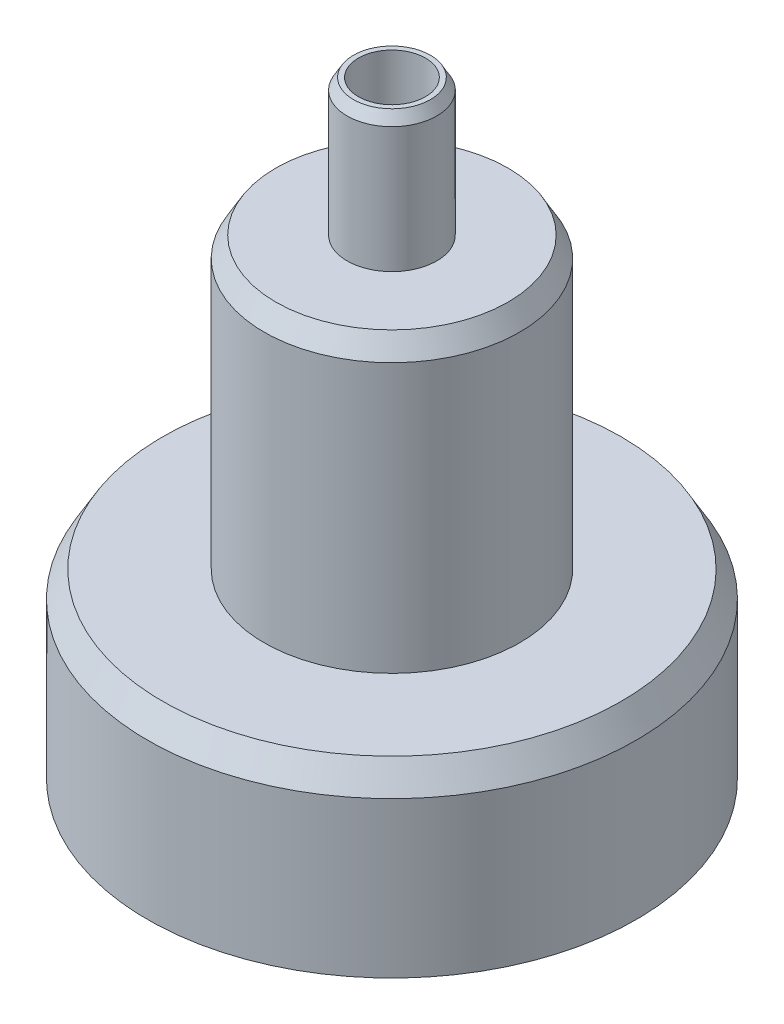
ISO-10303-21;
HEADER;
FILE_DESCRIPTION(('STEP AP214'),'2;1');
FILE_NAME('part.step','',(''),(''),'','','');
FILE_SCHEMA(('AUTOMOTIVE_DESIGN { 1 0 10303 214 1 1 1 1 }'));
ENDSEC;
DATA;
#1=APPLICATION_CONTEXT('core data for automotive mechanical design processes');
#2=APPLICATION_PROTOCOL_DEFINITION('international standard','automotive_design',2000,#1);
#3=PRODUCT_CONTEXT('',#1,'mechanical');
#4=PRODUCT('Part','Part','',(#3));
#5=PRODUCT_RELATED_PRODUCT_CATEGORY('part','',(#4));
#6=PRODUCT_DEFINITION_FORMATION('','',#4);
#7=PRODUCT_DEFINITION_CONTEXT('part definition',#1,'design');
#8=PRODUCT_DEFINITION('design','',#6,#7);
#9=PRODUCT_DEFINITION_SHAPE('','',#8);
#10=(LENGTH_UNIT() NAMED_UNIT(*) SI_UNIT(.MILLI.,.METRE.));
#11=(NAMED_UNIT(*) PLANE_ANGLE_UNIT() SI_UNIT($,.RADIAN.));
#12=(NAMED_UNIT(*) SI_UNIT($,.STERADIAN.) SOLID_ANGLE_UNIT());
#13=UNCERTAINTY_MEASURE_WITH_UNIT(LENGTH_MEASURE(1.E-05),#10,'distance_accuracy_value','');
#14=(GEOMETRIC_REPRESENTATION_CONTEXT(3) GLOBAL_UNCERTAINTY_ASSIGNED_CONTEXT((#13)) GLOBAL_UNIT_ASSIGNED_CONTEXT((#10,
#11,#12)) REPRESENTATION_CONTEXT('',''));
#15=CARTESIAN_POINT('',(0.,0.,0.));
#16=DIRECTION('',(0.,0.,1.));
#17=DIRECTION('',(1.,0.,0.));
#18=AXIS2_PLACEMENT_3D('',#15,#16,#17);
#19=CARTESIAN_POINT('',(0.,0.,0.));
#20=DIRECTION('',(0.,-1.,0.));
#21=DIRECTION('',(0.,0.,-1.));
#22=AXIS2_PLACEMENT_3D('',#19,#20,#21);
#23=CYLINDRICAL_SURFACE('',#22,34.6);
#24=CARTESIAN_POINT('',(0.,0.,0.));
#25=DIRECTION('',(0.,-1.,0.));
#26=DIRECTION('',(0.,0.,-1.));
#27=AXIS2_PLACEMENT_3D('',#24,#25,#26);
#28=CIRCLE('',#27,34.6);
#29=CARTESIAN_POINT('',(0.,0.,-34.6));
#30=VERTEX_POINT('',#29);
#31=EDGE_CURVE('E12',#30,#30,#28,.T.);
#32=ORIENTED_EDGE('',*,*,#31,.F.);
#33=EDGE_LOOP('',(#32));
#34=FACE_BOUND('',#33,.T.);
#35=CARTESIAN_POINT('',(0.,22.,0.));
#36=DIRECTION('',(0.,-1.,0.));
#37=DIRECTION('',(0.,0.,-1.));
#38=AXIS2_PLACEMENT_3D('',#35,#36,#37);
#39=CIRCLE('',#38,34.6);
#40=CARTESIAN_POINT('',(0.,22.,-34.6));
#41=VERTEX_POINT('',#40);
#42=EDGE_CURVE('E98',#41,#41,#39,.T.);
#43=ORIENTED_EDGE('',*,*,#42,.T.);
#44=EDGE_LOOP('',(#43));
#45=FACE_BOUND('',#44,.T.);
#46=ADVANCED_FACE('F40',(#34,#45),#23,.T.);
#47=CARTESIAN_POINT('',(-34.6,0.,0.));
#48=DIRECTION('',(0.,1.,0.));
#49=DIRECTION('',(0.,0.,1.));
#50=AXIS2_PLACEMENT_3D('',#47,#48,#49);
#51=PLANE('',#50);
#52=CARTESIAN_POINT('',(0.,0.,0.));
#53=DIRECTION('',(0.,-1.,0.));
#54=DIRECTION('',(0.,0.,-1.));
#55=AXIS2_PLACEMENT_3D('',#52,#53,#54);
#56=CIRCLE('',#55,30.9);
#57=CARTESIAN_POINT('',(0.,0.,-30.9));
#58=VERTEX_POINT('',#57);
#59=EDGE_CURVE('E46',#58,#58,#56,.T.);
#60=ORIENTED_EDGE('',*,*,#59,.F.);
#61=EDGE_LOOP('',(#60));
#62=FACE_BOUND('',#61,.T.);
#63=ORIENTED_EDGE('',*,*,#31,.T.);
#64=EDGE_LOOP('',(#63));
#65=FACE_BOUND('',#64,.T.);
#66=ADVANCED_FACE('F195',(#62,#65),#51,.F.);
#67=CARTESIAN_POINT('',(0.,0.,0.));
#68=DIRECTION('',(0.,-1.,0.));
#69=DIRECTION('',(0.,0.,-1.));
#70=AXIS2_PLACEMENT_3D('',#67,#68,#69);
#71=CYLINDRICAL_SURFACE('',#70,30.9);
#72=CARTESIAN_POINT('',(0.,2.,0.));
#73=DIRECTION('',(0.,-1.,0.));
#74=DIRECTION('',(0.,0.,-1.));
#75=AXIS2_PLACEMENT_3D('',#72,#73,#74);
#76=CIRCLE('',#75,30.9);
#77=CARTESIAN_POINT('',(0.,2.,-30.9));
#78=VERTEX_POINT('',#77);
#79=EDGE_CURVE('E50',#78,#78,#76,.T.);
#80=ORIENTED_EDGE('',*,*,#79,.F.);
#81=EDGE_LOOP('',(#80));
#82=FACE_BOUND('',#81,.T.);
#83=ORIENTED_EDGE('',*,*,#59,.T.);
#84=EDGE_LOOP('',(#83));
#85=FACE_BOUND('',#84,.T.);
#86=ADVANCED_FACE('F190',(#82,#85),#71,.F.);
#87=CARTESIAN_POINT('',(-30.9,2.,0.));
#88=DIRECTION('',(0.,-1.,0.));
#89=DIRECTION('',(0.,0.,-1.));
#90=AXIS2_PLACEMENT_3D('',#87,#88,#89);
#91=PLANE('',#90);
#92=CARTESIAN_POINT('',(0.,2.,0.));
#93=DIRECTION('',(0.,-1.,0.));
#94=DIRECTION('',(0.,0.,-1.));
#95=AXIS2_PLACEMENT_3D('',#92,#93,#94);
#96=CIRCLE('',#95,33.1606);
#97=CARTESIAN_POINT('',(0.,2.,-33.1606));
#98=VERTEX_POINT('',#97);
#99=EDGE_CURVE('E54',#98,#98,#96,.T.);
#100=ORIENTED_EDGE('',*,*,#99,.F.);
#101=EDGE_LOOP('',(#100));
#102=FACE_BOUND('',#101,.T.);
#103=ORIENTED_EDGE('',*,*,#79,.T.);
#104=EDGE_LOOP('',(#103));
#105=FACE_BOUND('',#104,.T.);
#106=ADVANCED_FACE('F184',(#102,#105),#91,.F.);
#107=CARTESIAN_POINT('',(0.,0.,0.));
#108=DIRECTION('',(0.,-1.,0.));
#109=DIRECTION('',(0.,0.,-1.));
#110=AXIS2_PLACEMENT_3D('',#107,#108,#109);
#111=CYLINDRICAL_SURFACE('',#110,33.1606);
#112=CARTESIAN_POINT('',(0.,5.07340000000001,0.));
#113=DIRECTION('',(0.,-1.,0.));
#114=DIRECTION('',(0.,0.,-1.));
#115=AXIS2_PLACEMENT_3D('',#112,#113,#114);
#116=CIRCLE('',#115,33.1606);
#117=CARTESIAN_POINT('',(0.,5.07340000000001,-33.1606));
#118=VERTEX_POINT('',#117);
#119=EDGE_CURVE('E59',#118,#118,#116,.T.);
#120=ORIENTED_EDGE('',*,*,#119,.F.);
#121=EDGE_LOOP('',(#120));
#122=FACE_BOUND('',#121,.T.);
#123=ORIENTED_EDGE('',*,*,#99,.T.);
#124=EDGE_LOOP('',(#123));
#125=FACE_BOUND('',#124,.T.);
#126=ADVANCED_FACE('F178',(#122,#125),#111,.F.);
#127=CARTESIAN_POINT('',(-30.9,5.07340000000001,0.));
#128=DIRECTION('',(0.,1.,0.));
#129=DIRECTION('',(0.,0.,1.));
#130=AXIS2_PLACEMENT_3D('',#127,#128,#129);
#131=PLANE('',#130);
#132=CARTESIAN_POINT('',(0.,5.07340000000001,0.));
#133=DIRECTION('',(0.,-1.,0.));
#134=DIRECTION('',(0.,0.,-1.));
#135=AXIS2_PLACEMENT_3D('',#132,#133,#134);
#136=CIRCLE('',#135,30.9);
#137=CARTESIAN_POINT('',(0.,5.07340000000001,-30.9));
#138=VERTEX_POINT('',#137);
#139=EDGE_CURVE('E62',#138,#138,#136,.T.);
#140=ORIENTED_EDGE('',*,*,#139,.F.);
#141=EDGE_LOOP('',(#140));
#142=FACE_BOUND('',#141,.T.);
#143=ORIENTED_EDGE('',*,*,#119,.T.);
#144=EDGE_LOOP('',(#143));
#145=FACE_BOUND('',#144,.T.);
#146=ADVANCED_FACE('F172',(#142,#145),#131,.F.);
#147=CARTESIAN_POINT('',(0.,0.,0.));
#148=DIRECTION('',(0.,-1.,0.));
#149=DIRECTION('',(0.,0.,-1.));
#150=AXIS2_PLACEMENT_3D('',#147,#148,#149);
#151=CYLINDRICAL_SURFACE('',#150,30.9);
#152=CARTESIAN_POINT('',(0.,12.7,0.));
#153=DIRECTION('',(0.,-1.,0.));
#154=DIRECTION('',(0.,0.,-1.));
#155=AXIS2_PLACEMENT_3D('',#152,#153,#154);
#156=CIRCLE('',#155,30.9);
#157=CARTESIAN_POINT('',(0.,12.7,-30.9));
#158=VERTEX_POINT('',#157);
#159=EDGE_CURVE('E65',#158,#158,#156,.T.);
#160=ORIENTED_EDGE('',*,*,#159,.F.);
#161=EDGE_LOOP('',(#160));
#162=FACE_BOUND('',#161,.T.);
#163=ORIENTED_EDGE('',*,*,#139,.T.);
#164=EDGE_LOOP('',(#163));
#165=FACE_BOUND('',#164,.T.);
#166=ADVANCED_FACE('F166',(#162,#165),#151,.F.);
#167=CARTESIAN_POINT('',(-30.9,12.7,0.));
#168=DIRECTION('',(0.,1.,0.));
#169=DIRECTION('',(0.,0.,1.));
#170=AXIS2_PLACEMENT_3D('',#167,#168,#169);
#171=PLANE('',#170);
#172=CARTESIAN_POINT('',(0.,12.7,0.));
#173=DIRECTION('',(0.,-1.,0.));
#174=DIRECTION('',(0.,0.,-1.));
#175=AXIS2_PLACEMENT_3D('',#172,#173,#174);
#176=CIRCLE('',#175,18.034);
#177=CARTESIAN_POINT('',(0.,12.7,-18.034));
#178=VERTEX_POINT('',#177);
#179=EDGE_CURVE('E68',#178,#178,#176,.T.);
#180=ORIENTED_EDGE('',*,*,#179,.F.);
#181=EDGE_LOOP('',(#180));
#182=FACE_BOUND('',#181,.T.);
#183=ORIENTED_EDGE('',*,*,#159,.T.);
#184=EDGE_LOOP('',(#183));
#185=FACE_BOUND('',#184,.T.);
#186=ADVANCED_FACE('F160',(#182,#185),#171,.F.);
#187=CARTESIAN_POINT('',(0.,12.7,0.));
#188=DIRECTION('',(0.,-1.,0.));
#189=DIRECTION('',(0.,0.,-1.));
#190=AXIS2_PLACEMENT_3D('',#187,#188,#189);
#191=CONICAL_SURFACE('',#190,18.034,0.533330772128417);
#192=CARTESIAN_POINT('',(0.,35.2,0.));
#193=DIRECTION('',(0.,-1.,0.));
#194=DIRECTION('',(0.,0.,-1.));
#195=AXIS2_PLACEMENT_3D('',#192,#193,#194);
#196=CIRCLE('',#195,4.75);
#197=CARTESIAN_POINT('',(0.,35.2,-4.74999999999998));
#198=VERTEX_POINT('',#197);
#199=EDGE_CURVE('E71',#198,#198,#196,.T.);
#200=CARTESIAN_POINT('',(0.,35.2,-4.74999999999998));
#201=CARTESIAN_POINT('',(0.,34.965625,-4.88837499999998));
#202=CARTESIAN_POINT('',(0.,34.73125,-5.02674999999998));
#203=CARTESIAN_POINT('',(0.,34.2625,-5.30349999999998));
#204=CARTESIAN_POINT('',(0.,34.028125,-5.44187499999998));
#205=CARTESIAN_POINT('',(0.,33.559375,-5.71862499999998));
#206=CARTESIAN_POINT('',(0.,33.325,-5.85699999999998));
#207=CARTESIAN_POINT('',(0.,32.85625,-6.13374999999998));
#208=CARTESIAN_POINT('',(0.,32.621875,-6.27212499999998));
#209=CARTESIAN_POINT('',(0.,32.153125,-6.54887499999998));
#210=CARTESIAN_POINT('',(0.,31.91875,-6.68724999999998));
#211=CARTESIAN_POINT('',(0.,31.45,-6.96399999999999));
#212=CARTESIAN_POINT('',(0.,31.215625,-7.10237499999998));
#213=CARTESIAN_POINT('',(0.,30.746875,-7.37912499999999));
#214=CARTESIAN_POINT('',(0.,30.5125,-7.51749999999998));
#215=CARTESIAN_POINT('',(0.,30.04375,-7.79424999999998));
#216=CARTESIAN_POINT('',(0.,29.809375,-7.93262499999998));
#217=CARTESIAN_POINT('',(0.,29.340625,-8.20937499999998));
#218=CARTESIAN_POINT('',(0.,29.10625,-8.34774999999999));
#219=CARTESIAN_POINT('',(0.,28.6375,-8.62449999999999));
#220=CARTESIAN_POINT('',(0.,28.403125,-8.76287499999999));
#221=CARTESIAN_POINT('',(0.,27.934375,-9.03962499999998));
#222=CARTESIAN_POINT('',(0.,27.7,-9.17799999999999));
#223=CARTESIAN_POINT('',(0.,27.23125,-9.45474999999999));
#224=CARTESIAN_POINT('',(0.,26.996875,-9.59312499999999));
#225=CARTESIAN_POINT('',(0.,26.528125,-9.86987499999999));
#226=CARTESIAN_POINT('',(0.,26.29375,-10.00825));
#227=CARTESIAN_POINT('',(0.,25.825,-10.285));
#228=CARTESIAN_POINT('',(0.,25.590625,-10.423375));
#229=CARTESIAN_POINT('',(0.,25.121875,-10.700125));
#230=CARTESIAN_POINT('',(0.,24.8875,-10.8385));
#231=CARTESIAN_POINT('',(0.,24.41875,-11.11525));
#232=CARTESIAN_POINT('',(0.,24.184375,-11.253625));
#233=CARTESIAN_POINT('',(0.,23.715625,-11.530375));
#234=CARTESIAN_POINT('',(0.,23.48125,-11.66875));
#235=CARTESIAN_POINT('',(0.,23.0125,-11.9455));
#236=CARTESIAN_POINT('',(0.,22.778125,-12.083875));
#237=CARTESIAN_POINT('',(0.,22.309375,-12.360625));
#238=CARTESIAN_POINT('',(0.,22.075,-12.499));
#239=CARTESIAN_POINT('',(0.,21.60625,-12.77575));
#240=CARTESIAN_POINT('',(0.,21.371875,-12.914125));
#241=CARTESIAN_POINT('',(0.,20.903125,-13.190875));
#242=CARTESIAN_POINT('',(0.,20.66875,-13.32925));
#243=CARTESIAN_POINT('',(0.,20.2,-13.606));
#244=CARTESIAN_POINT('',(0.,19.965625,-13.744375));
#245=CARTESIAN_POINT('',(0.,19.496875,-14.021125));
#246=CARTESIAN_POINT('',(0.,19.2625,-14.1595));
#247=CARTESIAN_POINT('',(0.,18.79375,-14.43625));
#248=CARTESIAN_POINT('',(0.,18.559375,-14.574625));
#249=CARTESIAN_POINT('',(0.,18.090625,-14.851375));
#250=CARTESIAN_POINT('',(0.,17.85625,-14.98975));
#251=CARTESIAN_POINT('',(0.,17.3875,-15.2665));
#252=CARTESIAN_POINT('',(0.,17.153125,-15.404875));
#253=CARTESIAN_POINT('',(0.,16.684375,-15.681625));
#254=CARTESIAN_POINT('',(0.,16.45,-15.82));
#255=CARTESIAN_POINT('',(0.,15.98125,-16.09675));
#256=CARTESIAN_POINT('',(0.,15.746875,-16.235125));
#257=CARTESIAN_POINT('',(0.,15.278125,-16.511875));
#258=CARTESIAN_POINT('',(0.,15.04375,-16.65025));
#259=CARTESIAN_POINT('',(0.,14.575,-16.927));
#260=CARTESIAN_POINT('',(0.,14.340625,-17.065375));
#261=CARTESIAN_POINT('',(0.,13.871875,-17.342125));
#262=CARTESIAN_POINT('',(0.,13.6375,-17.4805));
#263=CARTESIAN_POINT('',(0.,13.16875,-17.75725));
#264=CARTESIAN_POINT('',(0.,12.934375,-17.895625));
#265=CARTESIAN_POINT('',(0.,12.7,-18.034));
#266=B_SPLINE_CURVE_WITH_KNOTS('',3,(#200,#201,#202,#203,#204,#205,#206,#207,#208,#209,#210,
#211,#212,#213,#214,#215,#216,#217,#218,#219,#220,#221,#222,#223,#224,#225,#226,#227,#228,#229,
#230,#231,#232,#233,#234,#235,#236,#237,#238,#239,#240,#241,#242,#243,#244,#245,#246,#247,#248,
#249,#250,#251,#252,#253,#254,#255,#256,#257,#258,#259,#260,#261,#262,#263,#264,#265),
.UNSPECIFIED.,.F.,.F.,(4,2,2,2,2,2,2,2,2,2,2,2,2,2,2,2,2,2,2,2,2,2,2,2,2,2,2,2,2,2,2,2,4),(0.,
0.816525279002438,1.63305055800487,2.4495758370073,3.26610111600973,4.08262639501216,
4.8991516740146,5.71567695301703,6.53220223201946,7.3487275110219,8.16525279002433,
8.98177806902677,9.7983033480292,10.6148286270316,11.4313539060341,12.2478791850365,
13.0644044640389,13.8809297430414,14.6974550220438,15.5139803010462,16.3305055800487,
17.1470308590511,17.9635561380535,18.780081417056,19.5966066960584,20.4131319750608,
21.2296572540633,22.0461825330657,22.8627078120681,23.6792330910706,24.495758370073,
25.3122836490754,26.1288089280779),.UNSPECIFIED.);
#267=EDGE_CURVE('BSEAM154',#198,#178,#266,.T.);
#268=ORIENTED_EDGE('',*,*,#199,.F.);
#269=ORIENTED_EDGE('',*,*,#179,.T.);
#270=ORIENTED_EDGE('',*,*,#267,.T.);
#271=ORIENTED_EDGE('',*,*,#267,.F.);
#272=EDGE_LOOP('',(#268,#270,#269,#271));
#273=FACE_BOUND('',#272,.T.);
#274=ADVANCED_FACE('F154',(#273),#191,.F.);
#275=CARTESIAN_POINT('',(0.,0.,0.));
#276=DIRECTION('',(0.,-1.,0.));
#277=DIRECTION('',(0.,0.,-1.));
#278=AXIS2_PLACEMENT_3D('',#275,#276,#277);
#279=CYLINDRICAL_SURFACE('',#278,4.75);
#280=CARTESIAN_POINT('',(0.,86.,0.));
#281=DIRECTION('',(0.,-1.,0.));
#282=DIRECTION('',(0.,0.,-1.));
#283=AXIS2_PLACEMENT_3D('',#280,#281,#282);
#284=CIRCLE('',#283,4.75);
#285=CARTESIAN_POINT('',(0.,86.,-4.75));
#286=VERTEX_POINT('',#285);
#287=EDGE_CURVE('E74',#286,#286,#284,.T.);
#288=ORIENTED_EDGE('',*,*,#287,.F.);
#289=EDGE_LOOP('',(#288));
#290=FACE_BOUND('',#289,.T.);
#291=ORIENTED_EDGE('',*,*,#199,.T.);
#292=EDGE_LOOP('',(#291));
#293=FACE_BOUND('',#292,.T.);
#294=ADVANCED_FACE('F148',(#290,#293),#279,.F.);
#295=CARTESIAN_POINT('',(-4.75,86.,0.));
#296=DIRECTION('',(0.,-1.,0.));
#297=DIRECTION('',(0.,0.,-1.));
#298=AXIS2_PLACEMENT_3D('',#295,#296,#297);
#299=PLANE('',#298);
#300=CARTESIAN_POINT('',(0.,86.,0.));
#301=DIRECTION('',(0.,-1.,0.));
#302=DIRECTION('',(0.,0.,-1.));
#303=AXIS2_PLACEMENT_3D('',#300,#301,#302);
#304=CIRCLE('',#303,5.44933358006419);
#305=CARTESIAN_POINT('',(0.,86.,-5.44933358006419));
#306=VERTEX_POINT('',#305);
#307=EDGE_CURVE('E77',#306,#306,#304,.T.);
#308=ORIENTED_EDGE('',*,*,#307,.F.);
#309=EDGE_LOOP('',(#308));
#310=FACE_BOUND('',#309,.T.);
#311=ORIENTED_EDGE('',*,*,#287,.T.);
#312=EDGE_LOOP('',(#311));
#313=FACE_BOUND('',#312,.T.);
#314=ADVANCED_FACE('F142',(#310,#313),#299,.F.);
#315=CARTESIAN_POINT('',(0.,86.,0.));
#316=DIRECTION('',(0.,-1.,0.));
#317=DIRECTION('',(0.,0.,-1.));
#318=AXIS2_PLACEMENT_3D('',#315,#316,#317);
#319=CONICAL_SURFACE('',#318,5.44933358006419,0.523598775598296);
#320=CARTESIAN_POINT('',(0.,84.44,0.));
#321=DIRECTION('',(0.,-1.,0.));
#322=DIRECTION('',(0.,0.,-1.));
#323=AXIS2_PLACEMENT_3D('',#320,#321,#322);
#324=CIRCLE('',#323,6.35);
#325=CARTESIAN_POINT('',(0.,84.44,-6.35));
#326=VERTEX_POINT('',#325);
#327=EDGE_CURVE('E80',#326,#326,#324,.T.);
#328=ORIENTED_EDGE('',*,*,#327,.F.);
#329=EDGE_LOOP('',(#328));
#330=FACE_BOUND('',#329,.T.);
#331=ORIENTED_EDGE('',*,*,#307,.T.);
#332=EDGE_LOOP('',(#331));
#333=FACE_BOUND('',#332,.T.);
#334=ADVANCED_FACE('F136',(#330,#333),#319,.T.);
#335=CARTESIAN_POINT('',(0.,0.,0.));
#336=DIRECTION('',(0.,-1.,0.));
#337=DIRECTION('',(0.,0.,-1.));
#338=AXIS2_PLACEMENT_3D('',#335,#336,#337);
#339=CYLINDRICAL_SURFACE('',#338,6.35);
#340=CARTESIAN_POINT('',(0.,66.66,0.));
#341=DIRECTION('',(0.,-1.,0.));
#342=DIRECTION('',(0.,0.,-1.));
#343=AXIS2_PLACEMENT_3D('',#340,#341,#342);
#344=CIRCLE('',#343,6.35);
#345=CARTESIAN_POINT('',(0.,66.66,-6.35));
#346=VERTEX_POINT('',#345);
#347=EDGE_CURVE('E83',#346,#346,#344,.T.);
#348=ORIENTED_EDGE('',*,*,#347,.F.);
#349=EDGE_LOOP('',(#348));
#350=FACE_BOUND('',#349,.T.);
#351=ORIENTED_EDGE('',*,*,#327,.T.);
#352=EDGE_LOOP('',(#351));
#353=FACE_BOUND('',#352,.T.);
#354=ADVANCED_FACE('F130',(#350,#353),#339,.T.);
#355=CARTESIAN_POINT('',(-6.35,66.66,0.));
#356=DIRECTION('',(0.,-1.,0.));
#357=DIRECTION('',(0.,0.,-1.));
#358=AXIS2_PLACEMENT_3D('',#355,#356,#357);
#359=PLANE('',#358);
#360=CARTESIAN_POINT('',(0.,66.66,0.));
#361=DIRECTION('',(0.,-1.,0.));
#362=DIRECTION('',(0.,0.,-1.));
#363=AXIS2_PLACEMENT_3D('',#360,#361,#362);
#364=CIRCLE('',#363,16.4487782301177);
#365=CARTESIAN_POINT('',(0.,66.66,-16.4487782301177));
#366=VERTEX_POINT('',#365);
#367=EDGE_CURVE('E86',#366,#366,#364,.T.);
#368=ORIENTED_EDGE('',*,*,#367,.F.);
#369=EDGE_LOOP('',(#368));
#370=FACE_BOUND('',#369,.T.);
#371=ORIENTED_EDGE('',*,*,#347,.T.);
#372=EDGE_LOOP('',(#371));
#373=FACE_BOUND('',#372,.T.);
#374=ADVANCED_FACE('F124',(#370,#373),#359,.F.);
#375=CARTESIAN_POINT('',(0.,66.66,0.));
#376=DIRECTION('',(0.,-1.,0.));
#377=DIRECTION('',(0.,0.,-1.));
#378=AXIS2_PLACEMENT_3D('',#375,#376,#377);
#379=CONICAL_SURFACE('',#378,16.4487782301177,0.523598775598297);
#380=CARTESIAN_POINT('',(0.,63.8,0.));
#381=DIRECTION('',(0.,-1.,0.));
#382=DIRECTION('',(0.,0.,-1.));
#383=AXIS2_PLACEMENT_3D('',#380,#381,#382);
#384=CIRCLE('',#383,18.1);
#385=CARTESIAN_POINT('',(0.,63.8,-18.1));
#386=VERTEX_POINT('',#385);
#387=EDGE_CURVE('E89',#386,#386,#384,.T.);
#388=ORIENTED_EDGE('',*,*,#387,.F.);
#389=EDGE_LOOP('',(#388));
#390=FACE_BOUND('',#389,.T.);
#391=ORIENTED_EDGE('',*,*,#367,.T.);
#392=EDGE_LOOP('',(#391));
#393=FACE_BOUND('',#392,.T.);
#394=ADVANCED_FACE('F118',(#390,#393),#379,.T.);
#395=CARTESIAN_POINT('',(0.,0.,0.));
#396=DIRECTION('',(0.,-1.,0.));
#397=DIRECTION('',(0.,0.,-1.));
#398=AXIS2_PLACEMENT_3D('',#395,#396,#397);
#399=CYLINDRICAL_SURFACE('',#398,18.1);
#400=CARTESIAN_POINT('',(0.,25.7,0.));
#401=DIRECTION('',(0.,-1.,0.));
#402=DIRECTION('',(0.,0.,-1.));
#403=AXIS2_PLACEMENT_3D('',#400,#401,#402);
#404=CIRCLE('',#403,18.1);
#405=CARTESIAN_POINT('',(0.,25.7,-18.1));
#406=VERTEX_POINT('',#405);
#407=EDGE_CURVE('E92',#406,#406,#404,.T.);
#408=ORIENTED_EDGE('',*,*,#407,.F.);
#409=EDGE_LOOP('',(#408));
#410=FACE_BOUND('',#409,.T.);
#411=ORIENTED_EDGE('',*,*,#387,.T.);
#412=EDGE_LOOP('',(#411));
#413=FACE_BOUND('',#412,.T.);
#414=ADVANCED_FACE('F112',(#410,#413),#399,.T.);
#415=CARTESIAN_POINT('',(-18.1,25.7,0.));
#416=DIRECTION('',(0.,-1.,0.));
#417=DIRECTION('',(0.,0.,-1.));
#418=AXIS2_PLACEMENT_3D('',#415,#416,#417);
#419=PLANE('',#418);
#420=CARTESIAN_POINT('',(0.,25.7,0.));
#421=DIRECTION('',(0.,-1.,0.));
#422=DIRECTION('',(0.,0.,-1.));
#423=AXIS2_PLACEMENT_3D('',#420,#421,#422);
#424=CIRCLE('',#423,32.4638040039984);
#425=CARTESIAN_POINT('',(0.,25.7,-32.4638040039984));
#426=VERTEX_POINT('',#425);
#427=EDGE_CURVE('E95',#426,#426,#424,.T.);
#428=ORIENTED_EDGE('',*,*,#427,.F.);
#429=EDGE_LOOP('',(#428));
#430=FACE_BOUND('',#429,.T.);
#431=ORIENTED_EDGE('',*,*,#407,.T.);
#432=EDGE_LOOP('',(#431));
#433=FACE_BOUND('',#432,.T.);
#434=ADVANCED_FACE('F106',(#430,#433),#419,.F.);
#435=CARTESIAN_POINT('',(0.,25.7,0.));
#436=DIRECTION('',(0.,-1.,0.));
#437=DIRECTION('',(0.,0.,-1.));
#438=AXIS2_PLACEMENT_3D('',#435,#436,#437);
#439=CONICAL_SURFACE('',#438,32.4638040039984,0.523598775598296);
#440=ORIENTED_EDGE('',*,*,#42,.F.);
#441=EDGE_LOOP('',(#440));
#442=FACE_BOUND('',#441,.T.);
#443=ORIENTED_EDGE('',*,*,#427,.T.);
#444=EDGE_LOOP('',(#443));
#445=FACE_BOUND('',#444,.T.);
#446=ADVANCED_FACE('F103',(#442,#445),#439,.T.);
#447=CLOSED_SHELL('',(#46,#66,#86,#106,#126,#146,#166,#186,#274,#294,#314,#334,#354,#374,#394,
#414,#434,#446));
#448=MANIFOLD_SOLID_BREP('B2',#447);
#449=ADVANCED_BREP_SHAPE_REPRESENTATION('',(#18,#448),#14);
#450=SHAPE_DEFINITION_REPRESENTATION(#9,#449);
ENDSEC;
END-ISO-10303-21;
